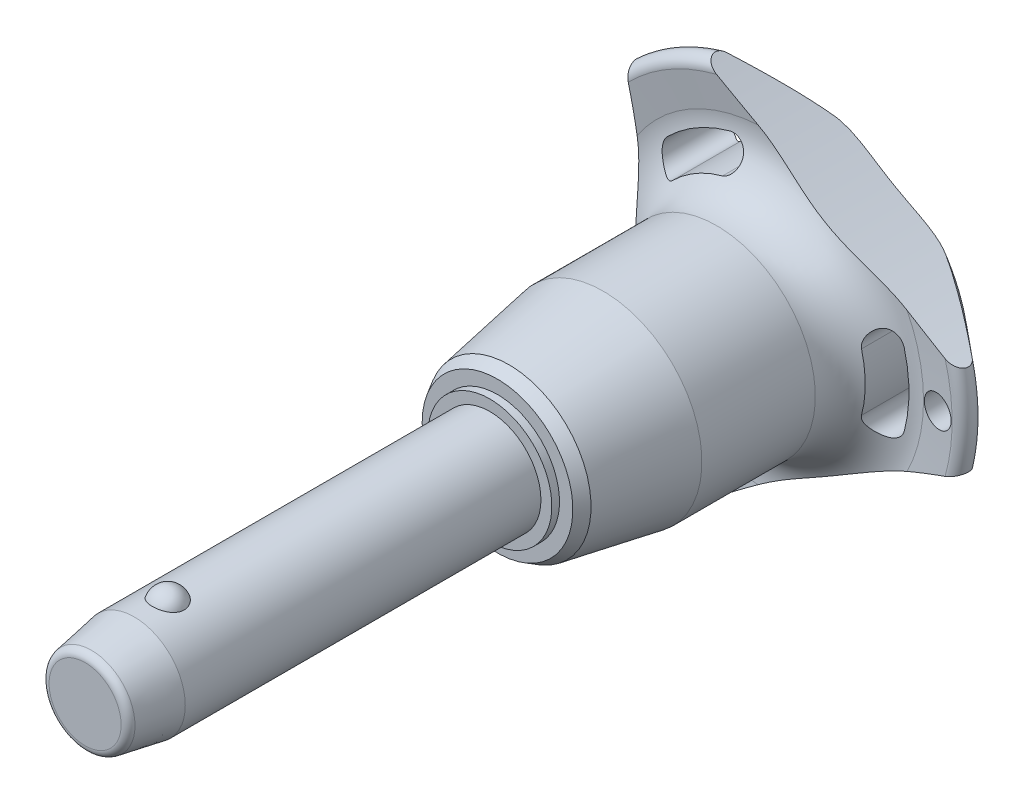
from build123d import *

# Parameters (mm, degrees)
SKETCH1_R           = 5
BOSS_EXTRUDE1_DEPTH = 30
SKETCH2_R           = 4.25
BOSS_EXTRUDE2_DEPTH = 33.3
BOSS_EXTRUDE3_START = 9.6
SKETCH1_2_R         = 5
BOSS_EXTRUDE3_DEPTH = 9.6
CHAMFER1_SIZE       = 4.8
CHAMFER1_SIZE2      = 0.846369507
FILLET1_R           = 0.75
SKETCH6_R           = 102.8
CUT_EXTRUDE1_DEPTH  = 70.10619492
CIRPATTERN1_COUNT   = 3
SKETCH7_R           = 1.5
CUT_EXTRUDE2_DEPTH  = 69.871754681


with BuildPart() as part:
    # Sketch1 → Boss-Extrude1 (new body)
    with BuildSketch(Plane.XY):
        Circle(SKETCH1_R)
    extrude(amount=-BOSS_EXTRUDE1_DEPTH)

    # Sketch2 → Boss-Extrude2 (add)
    with BuildSketch(Plane(origin=(0, 0, -30), x_dir=(-1, 0, 0), z_dir=(0, 0, -1))):
        Circle(SKETCH2_R)
    extrude(amount=BOSS_EXTRUDE2_DEPTH)

    # Sketch3 → Revolve1 (revolve)
    with BuildSketch(Plane(origin=(0, 0, 0), x_dir=(0, 0, -1), z_dir=(1, 0, 0))):
        with BuildLine():
            Line((-1.516575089, 6), (-1.516575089, 2.7))
            ThreePointArc((-1.516575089, 2.7), (0.133424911, 4.35), (-1.516575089, 6))
        make_face()
        with BuildLine():
            Line((-1.516575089, -2.7), (-1.516575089, -6))
            ThreePointArc((-1.516575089, -6), (0.133424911, -4.35), (-1.516575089, -2.7))
        make_face()
    revolve(axis=Axis((0, -2.7, 1.516575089), (0, 1, 0)))

    # Sketch1_2 → Boss-Extrude3 (add)
    with BuildSketch(Plane.XY.offset(BOSS_EXTRUDE3_START)):
        Circle(SKETCH1_2_R)
    extrude(amount=-BOSS_EXTRUDE3_DEPTH)

    # Chamfer1
    chamfer1_edges = [part.edges().sort_by_distance(p)[0] for p in [
        (-5, 0, 9.6),
    ]]
    chamfer1_side = [part.faces().sort_by_distance(p)[0] for p in [
        (-5, 0, -10.2),
    ]]
    chamfer(chamfer1_edges, length=CHAMFER1_SIZE, length2=CHAMFER1_SIZE2, reference=chamfer1_side[0])

    # Fillet1
    fillet1_edges = [part.edges().sort_by_distance(p)[0] for p in [
        (-4.153630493, 0, 9.6),
        (4.25, 0, -63.3),
    ]]
    fillet(fillet1_edges, radius=FILLET1_R)

    # Sketch4 → Revolve2 (revolve)
    with BuildSketch(Plane(origin=(0, 0, 0), x_dir=(0, 0, -1), z_dir=(1, 0, 0)), mode=Mode.PRIVATE) as revolve2_sk:
        Polygon((30, 0), (30, 6.067402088), (30.75, 6.067402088), (30.75, 7.371950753), (31.879772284, 8.024225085), (41.1, 9.65), (52.2, 9.65), (52.2, 0), align=None)
    revolve(revolve2_sk.sketch.rotate(Axis((0, 0, -52.2), (0, 0, 1)), 90), axis=Axis((0, 0, -52.2), (0, 0, 1)))

    # Sketch5 → Revolve3 (revolve)
    with BuildSketch(Plane(origin=(0, 0, 0), x_dir=(0, 0, -1), z_dir=(1, 0, 0)), mode=Mode.PRIVATE) as revolve3_sk:
        with BuildLine():
            Line((57.16082631, 15.274661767), (56.757834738, 18.475067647))
            ThreePointArc((56.757834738, 18.475067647), (57.349836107, 19.516443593), (58.516044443, 19.24278761))
            Line((58.516044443, 19.24278761), (62.835691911, 14.094832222))
            ThreePointArc((62.835691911, 14.094832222), (63.3, 12.689260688), (62.67067517, 11.349423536))
            ThreePointArc((62.67067517, 11.349423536), (59.033110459, 6.185112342), (57.75, 0))
            Line((57.75, 0), (52.2, 0))
            Line((52.2, 0), (52.2, 9.65))
            ThreePointArc((52.2, 9.65), (55.949887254, 11.342683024), (57.16082631, 15.274661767))
        make_face()
    revolve(revolve3_sk.sketch.rotate(Axis((0, 0, -57.75), (0, 0, 1)), 90), axis=Axis((0, 0, -57.75), (0, 0, 1)))

    # Sketch6 → Cut-Extrude1 (cut, through all)
    with BuildSketch(Plane.XY):
        with Locations((-115.2, 0)):
            Circle(SKETCH6_R)
        with BuildLine():
            ThreePointArc((13.411913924, -3.529271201), (13.868496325, 0), (13.411913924, 3.529271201))
            ThreePointArc((13.411913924, 3.529271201), (11.694200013, 4.531299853), (10.692171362, 2.813585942))
            ThreePointArc((10.692171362, 2.813585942), (11.056165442, 0), (10.692171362, -2.813585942))
            ThreePointArc((10.692171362, -2.813585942), (11.694200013, -4.531299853), (13.411913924, -3.529271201))
        make_face()
    cut_extrude1 = extrude(amount=-CUT_EXTRUDE1_DEPTH, mode=Mode.SUBTRACT)

    # CirPattern1: Cut-Extrude1 ×3 about axis
    cirpattern1_axis = Axis((0, 0, 0), (0, 0, 1))
    for i in range(1, CIRPATTERN1_COUNT):
        add(cut_extrude1.rotate(cirpattern1_axis, i * 360 / CIRPATTERN1_COUNT), mode=Mode.SUBTRACT)

    # Sketch7 → Cut-Extrude2 (cut, through all)
    with BuildSketch(Plane.XY):
        with Locations(Location((16.868496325, 0, 0), (0, 0, 225.467095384))):
            Circle(SKETCH7_R)
    extrude(amount=-CUT_EXTRUDE2_DEPTH, mode=Mode.SUBTRACT)


solid = part.part
